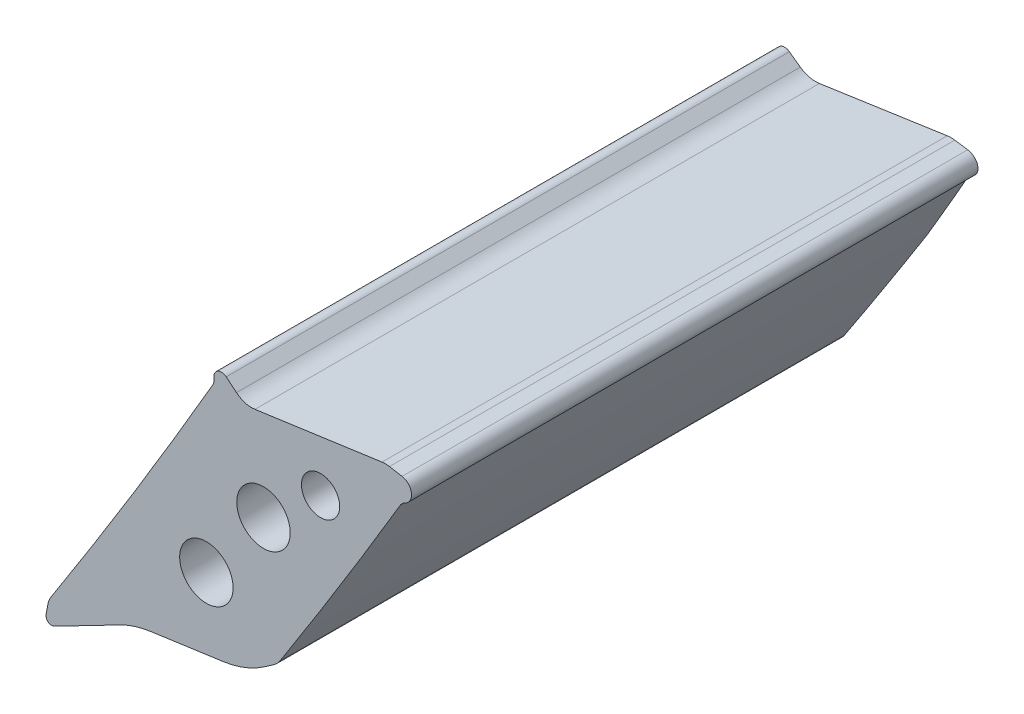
ISO-10303-21;
HEADER;
FILE_DESCRIPTION(('STEP AP214'),'2;1');
FILE_NAME('part.step','',(''),(''),'','','');
FILE_SCHEMA(('AUTOMOTIVE_DESIGN { 1 0 10303 214 1 1 1 1 }'));
ENDSEC;
DATA;
#1=APPLICATION_CONTEXT('core data for automotive mechanical design processes');
#2=APPLICATION_PROTOCOL_DEFINITION('international standard','automotive_design',2000,#1);
#3=PRODUCT_CONTEXT('',#1,'mechanical');
#4=PRODUCT('Part','Part','',(#3));
#5=PRODUCT_RELATED_PRODUCT_CATEGORY('part','',(#4));
#6=PRODUCT_DEFINITION_FORMATION('','',#4);
#7=PRODUCT_DEFINITION_CONTEXT('part definition',#1,'design');
#8=PRODUCT_DEFINITION('design','',#6,#7);
#9=PRODUCT_DEFINITION_SHAPE('','',#8);
#10=(LENGTH_UNIT() NAMED_UNIT(*) SI_UNIT(.MILLI.,.METRE.));
#11=(NAMED_UNIT(*) PLANE_ANGLE_UNIT() SI_UNIT($,.RADIAN.));
#12=(NAMED_UNIT(*) SI_UNIT($,.STERADIAN.) SOLID_ANGLE_UNIT());
#13=UNCERTAINTY_MEASURE_WITH_UNIT(LENGTH_MEASURE(1.E-05),#10,'distance_accuracy_value','');
#14=(GEOMETRIC_REPRESENTATION_CONTEXT(3) GLOBAL_UNCERTAINTY_ASSIGNED_CONTEXT((#13)) GLOBAL_UNIT_ASSIGNED_CONTEXT((#10,
#11,#12)) REPRESENTATION_CONTEXT('',''));
#15=CARTESIAN_POINT('',(0.,0.,0.));
#16=DIRECTION('',(0.,0.,1.));
#17=DIRECTION('',(1.,0.,0.));
#18=AXIS2_PLACEMENT_3D('',#15,#16,#17);
#19=CARTESIAN_POINT('',(-788.672703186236,20.720571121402,71.9582));
#20=DIRECTION('',(0.,0.,1.));
#21=DIRECTION('',(1.00000000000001,0.,0.));
#22=AXIS2_PLACEMENT_3D('',#19,#20,#21);
#23=PLANE('',#22);
#24=CARTESIAN_POINT('',(-762.88900000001,45.720000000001,71.9582));
#25=DIRECTION('',(0.,0.,-1.));
#26=DIRECTION('',(-1.00000000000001,0.,0.));
#27=AXIS2_PLACEMENT_3D('',#24,#25,#26);
#28=CIRCLE('',#27,3.56869999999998);
#29=CARTESIAN_POINT('',(-766.45770000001,45.720000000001,71.9582));
#30=VERTEX_POINT('',#29);
#31=EDGE_CURVE('E347',#30,#30,#28,.T.);
#32=ORIENTED_EDGE('',*,*,#31,.T.);
#33=EDGE_LOOP('',(#32));
#34=FACE_BOUND('',#33,.T.);
#35=CARTESIAN_POINT('',(-788.672703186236,20.720571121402,71.9582));
#36=DIRECTION('',(0.,0.,1.));
#37=DIRECTION('',(1.00000000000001,0.,0.));
#38=AXIS2_PLACEMENT_3D('',#35,#36,#37);
#39=CIRCLE('',#38,3.04799999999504);
#40=CARTESIAN_POINT('',(-791.234172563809,22.3725937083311,71.9582));
#41=VERTEX_POINT('',#40);
#42=CARTESIAN_POINT('',(-791.670058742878,21.2738917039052,71.9582));
#43=VERTEX_POINT('',#42);
#44=EDGE_CURVE('E351',#41,#43,#39,.T.);
#45=ORIENTED_EDGE('',*,*,#44,.T.);
#46=DIRECTION('',(-0.181535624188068,-0.983384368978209,0.));
#47=VECTOR('',#46,1.);
#48=CARTESIAN_POINT('',(-791.902339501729,20.0156192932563,71.9582));
#49=LINE('',#48,#47);
#50=CARTESIAN_POINT('',(-791.902339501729,20.0156192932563,71.9582));
#51=VERTEX_POINT('',#50);
#52=EDGE_CURVE('E720',#43,#51,#49,.T.);
#53=ORIENTED_EDGE('',*,*,#52,.T.);
#54=CARTESIAN_POINT('',(-791.153000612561,19.8772891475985,71.9582));
#55=DIRECTION('',(0.,0.,1.));
#56=DIRECTION('',(1.00000000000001,0.,0.));
#57=AXIS2_PLACEMENT_3D('',#54,#55,#56);
#58=CIRCLE('',#57,0.761999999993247);
#59=CARTESIAN_POINT('',(-790.803192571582,19.2003265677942,71.9582));
#60=VERTEX_POINT('',#59);
#61=EDGE_CURVE('E725',#51,#60,#58,.T.);
#62=ORIENTED_EDGE('',*,*,#61,.T.);
#63=DIRECTION('',(0.888402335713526,0.459065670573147,0.));
#64=VECTOR('',#63,1.);
#65=CARTESIAN_POINT('',(-790.803192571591,19.2003265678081,71.9582));
#66=LINE('',#65,#64);
#67=CARTESIAN_POINT('',(-782.053130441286,23.7217612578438,71.9582));
#68=VERTEX_POINT('',#67);
#69=EDGE_CURVE('E734',#60,#68,#66,.T.);
#70=ORIENTED_EDGE('',*,*,#69,.T.);
#71=CARTESIAN_POINT('',(-776.222996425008,12.4390515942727,71.9582));
#72=DIRECTION('',(0.,0.,-1.));
#73=DIRECTION('',(-1.00000000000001,0.,0.));
#74=AXIS2_PLACEMENT_3D('',#71,#72,#73);
#75=CIRCLE('',#74,12.7000000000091);
#76=CARTESIAN_POINT('',(-777.990494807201,25.0154560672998,71.9582));
#77=VERTEX_POINT('',#76);
#78=EDGE_CURVE('E736',#68,#77,#75,.T.);
#79=ORIENTED_EDGE('',*,*,#78,.T.);
#80=DIRECTION('',(0.990268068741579,0.13917310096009,0.));
#81=VECTOR('',#80,1.);
#82=CARTESIAN_POINT('',(-777.9904948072,25.0154560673,71.9582));
#83=LINE('',#82,#81);
#84=CARTESIAN_POINT('',(-768.23713557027,26.3862013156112,71.9582));
#85=VERTEX_POINT('',#84);
#86=EDGE_CURVE('E740',#77,#85,#83,.T.);
#87=ORIENTED_EDGE('',*,*,#86,.T.);
#88=CARTESIAN_POINT('',(-770.00463395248,38.9626057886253,71.9582));
#89=DIRECTION('',(0.,0.,1.));
#90=DIRECTION('',(-1.00000000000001,0.,0.));
#91=AXIS2_PLACEMENT_3D('',#88,#89,#90);
#92=CIRCLE('',#91,12.7000000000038);
#93=CARTESIAN_POINT('',(-762.747509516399,28.5403150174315,71.9582));
#94=VERTEX_POINT('',#93);
#95=EDGE_CURVE('E743',#85,#94,#92,.T.);
#96=ORIENTED_EDGE('',*,*,#95,.T.);
#97=DIRECTION('',(0.820652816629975,0.57142712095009,0.));
#98=VECTOR('',#97,1.);
#99=CARTESIAN_POINT('',(-761.496834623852,29.4111699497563,71.9582));
#100=LINE('',#99,#98);
#101=CARTESIAN_POINT('',(-761.496834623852,29.4111699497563,71.9582));
#102=VERTEX_POINT('',#101);
#103=EDGE_CURVE('E746',#94,#102,#100,.T.);
#104=ORIENTED_EDGE('',*,*,#103,.T.);
#105=CARTESIAN_POINT('',(-763.238544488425,31.9125197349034,71.9582));
#106=DIRECTION('',(0.,0.,1.));
#107=DIRECTION('',(1.00000000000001,0.,0.));
#108=AXIS2_PLACEMENT_3D('',#105,#106,#107);
#109=CIRCLE('',#108,3.0480000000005);
#110=CARTESIAN_POINT('',(-760.67385604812,30.2654990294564,71.9582));
#111=VERTEX_POINT('',#110);
#112=EDGE_CURVE('E748',#102,#111,#109,.T.);
#113=ORIENTED_EDGE('',*,*,#112,.T.);
#114=CARTESIAN_POINT('',(-1472.81446147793,487.59602850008,71.9582));
#115=DIRECTION('',(0.,0.,1.));
#116=DIRECTION('',(1.00000000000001,0.,0.));
#117=AXIS2_PLACEMENT_3D('',#114,#115,#116);
#118=CIRCLE('',#117,846.342398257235);
#119=CARTESIAN_POINT('',(-744.63617179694,56.2587665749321,71.9582));
#120=VERTEX_POINT('',#119);
#121=EDGE_CURVE('E662',#111,#120,#118,.T.);
#122=ORIENTED_EDGE('',*,*,#121,.T.);
#123=CARTESIAN_POINT('',(-743.324948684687,55.482062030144,71.9582));
#124=DIRECTION('',(0.,0.,-1.));
#125=DIRECTION('',(-1.00000000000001,0.,0.));
#126=AXIS2_PLACEMENT_3D('',#123,#124,#125);
#127=CIRCLE('',#126,1.52399999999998);
#128=CARTESIAN_POINT('',(-743.989658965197,56.8534614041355,71.9582));
#129=VERTEX_POINT('',#128);
#130=EDGE_CURVE('E652',#120,#129,#127,.T.);
#131=ORIENTED_EDGE('',*,*,#130,.T.);
#132=CARTESIAN_POINT('',(-744.654369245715,58.2248607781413,71.9582));
#133=DIRECTION('',(0.,0.,1.));
#134=DIRECTION('',(1.00000000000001,0.,0.));
#135=AXIS2_PLACEMENT_3D('',#132,#133,#134);
#136=CIRCLE('',#135,1.52400000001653);
#137=CARTESIAN_POINT('',(-744.389729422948,59.725707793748,71.9582));
#138=VERTEX_POINT('',#137);
#139=EDGE_CURVE('E648',#129,#138,#136,.T.);
#140=ORIENTED_EDGE('',*,*,#139,.T.);
#141=DIRECTION('',(-0.98480775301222,0.17364817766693,0.));
#142=VECTOR('',#141,1.);
#143=CARTESIAN_POINT('',(-746.074422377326,60.022764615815,71.9582));
#144=LINE('',#143,#142);
#145=CARTESIAN_POINT('',(-746.074422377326,60.022764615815,71.9582));
#146=VERTEX_POINT('',#145);
#147=EDGE_CURVE('E666',#138,#146,#144,.T.);
#148=ORIENTED_EDGE('',*,*,#147,.T.);
#149=CARTESIAN_POINT('',(-746.625755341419,56.8960000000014,71.9582));
#150=DIRECTION('',(0.,0.,1.));
#151=DIRECTION('',(-1.00000000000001,0.,0.));
#152=AXIS2_PLACEMENT_3D('',#149,#150,#151);
#153=CIRCLE('',#152,3.17500000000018);
#154=CARTESIAN_POINT('',(-747.067629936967,60.0401011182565,71.9582));
#155=VERTEX_POINT('',#154);
#156=EDGE_CURVE('E668',#146,#155,#153,.T.);
#157=ORIENTED_EDGE('',*,*,#156,.T.);
#158=DIRECTION('',(-0.990268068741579,-0.139173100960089,0.));
#159=VECTOR('',#158,1.);
#160=CARTESIAN_POINT('',(-764.023887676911,57.657054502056,71.9582));
#161=LINE('',#160,#159);
#162=CARTESIAN_POINT('',(-764.023887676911,57.657054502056,71.9582));
#163=VERTEX_POINT('',#162);
#164=EDGE_CURVE('E579',#155,#163,#161,.T.);
#165=ORIENTED_EDGE('',*,*,#164,.T.);
#166=CARTESIAN_POINT('',(-764.46576227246,60.8011556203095,71.9582));
#167=DIRECTION('',(0.,0.,-1.));
#168=DIRECTION('',(1.00000000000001,0.,0.));
#169=AXIS2_PLACEMENT_3D('',#166,#167,#168);
#170=CIRCLE('',#169,3.17499999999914);
#171=CARTESIAN_POINT('',(-766.493107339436,58.3576955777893,71.9582));
#172=VERTEX_POINT('',#171);
#173=EDGE_CURVE('E575',#163,#172,#170,.T.);
#174=ORIENTED_EDGE('',*,*,#173,.T.);
#175=DIRECTION('',(-0.769593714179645,0.638533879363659,0.));
#176=VECTOR('',#175,1.);
#177=CARTESIAN_POINT('',(-767.861444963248,59.4930088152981,71.9582));
#178=LINE('',#177,#176);
#179=CARTESIAN_POINT('',(-767.861444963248,59.4930088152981,71.9582));
#180=VERTEX_POINT('',#179);
#181=EDGE_CURVE('E572',#172,#180,#178,.T.);
#182=ORIENTED_EDGE('',*,*,#181,.T.);
#183=CARTESIAN_POINT('',(-768.499978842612,58.7234151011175,71.9582));
#184=DIRECTION('',(0.,0.,1.));
#185=DIRECTION('',(1.00000000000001,0.,0.));
#186=AXIS2_PLACEMENT_3D('',#183,#184,#185);
#187=CIRCLE('',#186,1.00000000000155);
#188=CARTESIAN_POINT('',(-769.491045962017,58.5900510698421,71.9582));
#189=VERTEX_POINT('',#188);
#190=EDGE_CURVE('E569',#180,#189,#187,.T.);
#191=ORIENTED_EDGE('',*,*,#190,.T.);
#192=CARTESIAN_POINT('',(-771.001432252,58.3868042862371,71.9582));
#193=DIRECTION('',(0.,0.,-1.));
#194=DIRECTION('',(1.00000000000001,0.,0.));
#195=AXIS2_PLACEMENT_3D('',#192,#193,#194);
#196=CIRCLE('',#195,1.52400000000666);
#197=CARTESIAN_POINT('',(-769.682432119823,57.6233813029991,71.9582));
#198=VERTEX_POINT('',#197);
#199=EDGE_CURVE('E565',#189,#198,#196,.T.);
#200=ORIENTED_EDGE('',*,*,#199,.T.);
#201=CARTESIAN_POINT('',(-1512.56546147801,487.596028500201,71.9582));
#202=DIRECTION('',(0.,0.,-1.));
#203=DIRECTION('',(1.00000000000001,0.,0.));
#204=AXIS2_PLACEMENT_3D('',#201,#202,#203);
#205=CIRCLE('',#204,858.342398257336);
#206=EDGE_CURVE('E551',#198,#41,#205,.T.);
#207=ORIENTED_EDGE('',*,*,#206,.T.);
#208=EDGE_LOOP('',(#45,#53,#62,#70,#79,#87,#96,#104,#113,#122,#131,#140,#148,#157,#165,#174,
#182,#191,#200,#207));
#209=FACE_BOUND('',#208,.T.);
#210=CARTESIAN_POINT('',(-755.26900000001,52.0700000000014,71.9582));
#211=DIRECTION('',(0.,0.,1.));
#212=DIRECTION('',(1.00000000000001,0.,0.));
#213=AXIS2_PLACEMENT_3D('',#210,#211,#212);
#214=CIRCLE('',#213,2.55269999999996);
#215=CARTESIAN_POINT('',(-752.71630000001,52.0700000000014,71.9582));
#216=VERTEX_POINT('',#215);
#217=EDGE_CURVE('E356',#216,#216,#214,.T.);
#218=ORIENTED_EDGE('',*,*,#217,.F.);
#219=EDGE_LOOP('',(#218));
#220=FACE_BOUND('',#219,.T.);
#221=CARTESIAN_POINT('',(-770.509000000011,35.5600000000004,71.9582));
#222=DIRECTION('',(0.,0.,-1.));
#223=DIRECTION('',(-1.00000000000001,0.,0.));
#224=AXIS2_PLACEMENT_3D('',#221,#222,#223);
#225=CIRCLE('',#224,3.56869999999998);
#226=CARTESIAN_POINT('',(-774.077700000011,35.5600000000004,71.9582));
#227=VERTEX_POINT('',#226);
#228=EDGE_CURVE('E359',#227,#227,#225,.T.);
#229=ORIENTED_EDGE('',*,*,#228,.T.);
#230=EDGE_LOOP('',(#229));
#231=FACE_BOUND('',#230,.T.);
#232=ADVANCED_FACE('F62',(#34,#209,#220,#231),#23,.T.);
#233=CARTESIAN_POINT('',(-788.672703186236,20.720571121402,71.9582));
#234=DIRECTION('',(0.,0.,-1.));
#235=DIRECTION('',(-1.00000000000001,0.,0.));
#236=AXIS2_PLACEMENT_3D('',#233,#234,#235);
#237=CYLINDRICAL_SURFACE('',#236,3.04799999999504);
#238=DIRECTION('',(0.,0.,-1.));
#239=VECTOR('',#238,1.);
#240=CARTESIAN_POINT('',(-791.234172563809,22.3725937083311,71.9582));
#241=LINE('',#240,#239);
#242=CARTESIAN_POINT('',(-791.234172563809,22.3725937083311,-3.37509347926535));
#243=VERTEX_POINT('',#242);
#244=EDGE_CURVE('E545',#41,#243,#241,.T.);
#245=ORIENTED_EDGE('',*,*,#244,.T.);
#246=CARTESIAN_POINT('',(-788.672703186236,20.720571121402,-3.23729267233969));
#247=DIRECTION('',(-0.0146503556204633,0.0605359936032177,0.998058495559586));
#248=DIRECTION('',(-0.234763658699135,0.970055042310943,-0.0622835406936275));
#249=AXIS2_PLACEMENT_3D('',#246,#247,#248);
#250=ELLIPSE('',#249,3.05392921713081,3.04799999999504);
#251=CARTESIAN_POINT('',(-791.670058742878,21.2738917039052,-3.31485138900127));
#252=VERTEX_POINT('',#251);
#253=EDGE_CURVE('E78',#243,#252,#250,.T.);
#254=ORIENTED_EDGE('',*,*,#253,.T.);
#255=DIRECTION('',(0.,0.,-1.));
#256=VECTOR('',#255,1.);
#257=CARTESIAN_POINT('',(-791.670058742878,21.2738917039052,71.9582));
#258=LINE('',#257,#256);
#259=EDGE_CURVE('E528',#43,#252,#258,.T.);
#260=ORIENTED_EDGE('',*,*,#259,.F.);
#261=ORIENTED_EDGE('',*,*,#44,.F.);
#262=EDGE_LOOP('',(#245,#254,#260,#261));
#263=FACE_BOUND('',#262,.T.);
#264=ADVANCED_FACE('F64',(#263),#237,.T.);
#265=CARTESIAN_POINT('',(-791.902339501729,20.0156192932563,71.9582));
#266=DIRECTION('',(0.983384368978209,-0.181535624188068,0.));
#267=DIRECTION('',(0.181535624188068,0.983384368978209,0.));
#268=AXIS2_PLACEMENT_3D('',#265,#266,#267);
#269=PLANE('',#268);
#270=ORIENTED_EDGE('',*,*,#259,.T.);
#271=DIRECTION('',(-0.181241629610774,-0.981791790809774,0.0568889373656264));
#272=VECTOR('',#271,1.);
#273=CARTESIAN_POINT('',(-792.677701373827,15.8154588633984,-2.99856799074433));
#274=LINE('',#273,#272);
#275=CARTESIAN_POINT('',(-791.902339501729,20.0156192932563,-3.24194206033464));
#276=VERTEX_POINT('',#275);
#277=EDGE_CURVE('E508',#252,#276,#274,.T.);
#278=ORIENTED_EDGE('',*,*,#277,.T.);
#279=DIRECTION('',(0.,0.,-1.));
#280=VECTOR('',#279,1.);
#281=CARTESIAN_POINT('',(-791.902339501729,20.0156192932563,71.9582));
#282=LINE('',#281,#280);
#283=EDGE_CURVE('E523',#51,#276,#282,.T.);
#284=ORIENTED_EDGE('',*,*,#283,.F.);
#285=ORIENTED_EDGE('',*,*,#52,.F.);
#286=EDGE_LOOP('',(#270,#278,#284,#285));
#287=FACE_BOUND('',#286,.T.);
#288=ADVANCED_FACE('F342',(#287),#269,.F.);
#289=CARTESIAN_POINT('',(-791.153000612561,19.8772891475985,71.9582));
#290=DIRECTION('',(0.,0.,-1.));
#291=DIRECTION('',(-1.00000000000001,0.,0.));
#292=AXIS2_PLACEMENT_3D('',#289,#290,#291);
#293=CYLINDRICAL_SURFACE('',#292,0.761999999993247);
#294=ORIENTED_EDGE('',*,*,#283,.T.);
#295=CARTESIAN_POINT('',(-791.153000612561,19.8772891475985,-3.2225523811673));
#296=DIRECTION('',(-0.0146503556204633,0.0605359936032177,0.998058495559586));
#297=DIRECTION('',(-0.234763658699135,0.970055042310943,-0.0622835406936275));
#298=AXIS2_PLACEMENT_3D('',#295,#296,#297);
#299=ELLIPSE('',#298,0.763482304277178,0.761999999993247);
#300=CARTESIAN_POINT('',(-790.803192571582,19.2003265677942,-3.17635727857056));
#301=VERTEX_POINT('',#300);
#302=EDGE_CURVE('E503',#276,#301,#299,.T.);
#303=ORIENTED_EDGE('',*,*,#302,.T.);
#304=DIRECTION('',(0.,0.,-1.));
#305=VECTOR('',#304,1.);
#306=CARTESIAN_POINT('',(-790.803192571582,19.2003265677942,71.9582));
#307=LINE('',#306,#305);
#308=EDGE_CURVE('E520',#60,#301,#307,.T.);
#309=ORIENTED_EDGE('',*,*,#308,.F.);
#310=ORIENTED_EDGE('',*,*,#61,.F.);
#311=EDGE_LOOP('',(#294,#303,#309,#310));
#312=FACE_BOUND('',#311,.T.);
#313=ADVANCED_FACE('F836',(#312),#293,.T.);
#314=CARTESIAN_POINT('',(-790.803192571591,19.2003265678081,71.9582));
#315=DIRECTION('',(-0.459065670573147,0.888402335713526,0.));
#316=DIRECTION('',(-0.888402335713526,-0.459065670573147,0.));
#317=AXIS2_PLACEMENT_3D('',#314,#315,#316);
#318=PLANE('',#317);
#319=ORIENTED_EDGE('',*,*,#308,.T.);
#320=DIRECTION('',(0.888305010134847,0.459015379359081,-0.0148017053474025));
#321=VECTOR('',#320,1.);
#322=CARTESIAN_POINT('',(-791.791093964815,18.6898465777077,-3.15989601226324));
#323=LINE('',#322,#321);
#324=CARTESIAN_POINT('',(-782.053130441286,23.7217612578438,-3.32215837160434));
#325=VERTEX_POINT('',#324);
#326=EDGE_CURVE('E499',#301,#325,#323,.T.);
#327=ORIENTED_EDGE('',*,*,#326,.T.);
#328=DIRECTION('',(0.,0.,-1.));
#329=VECTOR('',#328,1.);
#330=CARTESIAN_POINT('',(-782.053130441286,23.7217612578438,71.9582));
#331=LINE('',#330,#329);
#332=EDGE_CURVE('E515',#68,#325,#331,.T.);
#333=ORIENTED_EDGE('',*,*,#332,.F.);
#334=ORIENTED_EDGE('',*,*,#69,.F.);
#335=EDGE_LOOP('',(#319,#327,#333,#334));
#336=FACE_BOUND('',#335,.T.);
#337=ADVANCED_FACE('F832',(#336),#318,.F.);
#338=CARTESIAN_POINT('',(-776.222996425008,12.4390515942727,71.9582));
#339=DIRECTION('',(0.,0.,-1.));
#340=DIRECTION('',(-1.00000000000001,0.,0.));
#341=AXIS2_PLACEMENT_3D('',#338,#339,#340);
#342=CYLINDRICAL_SURFACE('',#341,12.7000000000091);
#343=ORIENTED_EDGE('',*,*,#332,.T.);
#344=CARTESIAN_POINT('',(-776.222996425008,12.4390515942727,-2.55223999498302));
#345=DIRECTION('',(-0.0146503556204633,0.0605359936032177,0.998058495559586));
#346=DIRECTION('',(-0.234763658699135,0.970055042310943,-0.0622835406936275));
#347=AXIS2_PLACEMENT_3D('',#344,#345,#346);
#348=ELLIPSE('',#347,12.7247050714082,12.7000000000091);
#349=CARTESIAN_POINT('',(-777.990494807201,25.0154560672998,-3.34099097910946));
#350=VERTEX_POINT('',#349);
#351=EDGE_CURVE('E495',#325,#350,#348,.F.);
#352=ORIENTED_EDGE('',*,*,#351,.T.);
#353=DIRECTION('',(0.,0.,-1.));
#354=VECTOR('',#353,1.);
#355=CARTESIAN_POINT('',(-777.990494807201,25.0154560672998,71.9582));
#356=LINE('',#355,#354);
#357=EDGE_CURVE('E480',#77,#350,#356,.T.);
#358=ORIENTED_EDGE('',*,*,#357,.F.);
#359=ORIENTED_EDGE('',*,*,#78,.F.);
#360=EDGE_LOOP('',(#343,#352,#358,#359));
#361=FACE_BOUND('',#360,.T.);
#362=ADVANCED_FACE('F828',(#361),#342,.F.);
#363=CARTESIAN_POINT('',(-777.9904948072,25.0154560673,71.9582));
#364=DIRECTION('',(-0.13917310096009,0.990268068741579,0.));
#365=DIRECTION('',(-0.990268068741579,-0.13917310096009,0.));
#366=AXIS2_PLACEMENT_3D('',#363,#364,#365);
#367=PLANE('',#366);
#368=ORIENTED_EDGE('',*,*,#357,.T.);
#369=DIRECTION('',(0.990249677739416,0.139170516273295,0.00609451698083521));
#370=VECTOR('',#369,1.);
#371=CARTESIAN_POINT('',(-777.536057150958,25.0793231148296,-3.33819413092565));
#372=LINE('',#371,#370);
#373=CARTESIAN_POINT('',(-768.23713557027,26.3862013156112,-3.28096368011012));
#374=VERTEX_POINT('',#373);
#375=EDGE_CURVE('E491',#350,#374,#372,.T.);
#376=ORIENTED_EDGE('',*,*,#375,.T.);
#377=DIRECTION('',(0.,0.,-1.));
#378=VECTOR('',#377,1.);
#379=CARTESIAN_POINT('',(-768.23713557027,26.3862013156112,71.9582));
#380=LINE('',#379,#378);
#381=EDGE_CURVE('E475',#85,#374,#380,.T.);
#382=ORIENTED_EDGE('',*,*,#381,.F.);
#383=ORIENTED_EDGE('',*,*,#86,.F.);
#384=EDGE_LOOP('',(#368,#376,#382,#383));
#385=FACE_BOUND('',#384,.T.);
#386=ADVANCED_FACE('F824',(#385),#367,.F.);
#387=CARTESIAN_POINT('',(-770.00463395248,38.9626057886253,71.9582));
#388=DIRECTION('',(0.,0.,-1.));
#389=DIRECTION('',(-1.00000000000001,0.,0.));
#390=AXIS2_PLACEMENT_3D('',#387,#388,#389);
#391=CYLINDRICAL_SURFACE('',#390,12.7000000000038);
#392=ORIENTED_EDGE('',*,*,#381,.T.);
#393=CARTESIAN_POINT('',(-770.00463395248,38.9626057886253,-4.06971466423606));
#394=DIRECTION('',(-0.0146503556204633,0.0605359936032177,0.998058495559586));
#395=DIRECTION('',(-0.234763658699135,0.970055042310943,-0.0622835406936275));
#396=AXIS2_PLACEMENT_3D('',#393,#394,#395);
#397=ELLIPSE('',#396,12.7247050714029,12.7000000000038);
#398=CARTESIAN_POINT('',(-762.747509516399,28.5403150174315,-3.33103733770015));
#399=VERTEX_POINT('',#398);
#400=EDGE_CURVE('E446',#374,#399,#397,.T.);
#401=ORIENTED_EDGE('',*,*,#400,.T.);
#402=DIRECTION('',(0.,0.,-1.));
#403=VECTOR('',#402,1.);
#404=CARTESIAN_POINT('',(-762.747509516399,28.5403150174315,71.9582));
#405=LINE('',#404,#403);
#406=EDGE_CURVE('E471',#94,#399,#405,.T.);
#407=ORIENTED_EDGE('',*,*,#406,.F.);
#408=ORIENTED_EDGE('',*,*,#95,.F.);
#409=EDGE_LOOP('',(#392,#401,#407,#408));
#410=FACE_BOUND('',#409,.T.);
#411=ADVANCED_FACE('F820',(#410),#391,.T.);
#412=CARTESIAN_POINT('',(-761.496834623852,29.4111699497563,71.9582));
#413=DIRECTION('',(-0.57142712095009,0.820652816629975,0.));
#414=DIRECTION('',(-0.820652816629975,-0.57142712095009,0.));
#415=AXIS2_PLACEMENT_3D('',#412,#413,#414);
#416=PLANE('',#415);
#417=ORIENTED_EDGE('',*,*,#406,.T.);
#418=DIRECTION('',(0.82044307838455,0.571281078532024,-0.0226071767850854));
#419=VECTOR('',#418,1.);
#420=CARTESIAN_POINT('',(-762.893931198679,28.4383604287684,-3.32700271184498));
#421=LINE('',#420,#419);
#422=CARTESIAN_POINT('',(-761.496834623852,29.4111699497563,-3.36549948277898));
#423=VERTEX_POINT('',#422);
#424=EDGE_CURVE('E443',#399,#423,#421,.T.);
#425=ORIENTED_EDGE('',*,*,#424,.T.);
#426=DIRECTION('',(0.,0.,-1.));
#427=VECTOR('',#426,1.);
#428=CARTESIAN_POINT('',(-761.496834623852,29.4111699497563,71.9582));
#429=LINE('',#428,#427);
#430=EDGE_CURVE('E441',#102,#423,#429,.T.);
#431=ORIENTED_EDGE('',*,*,#430,.F.);
#432=ORIENTED_EDGE('',*,*,#103,.F.);
#433=EDGE_LOOP('',(#417,#425,#431,#432));
#434=FACE_BOUND('',#433,.T.);
#435=ADVANCED_FACE('F817',(#434),#416,.F.);
#436=CARTESIAN_POINT('',(-763.238544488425,31.9125197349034,71.9582));
#437=DIRECTION('',(0.,0.,-1.));
#438=DIRECTION('',(-1.00000000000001,0.,0.));
#439=AXIS2_PLACEMENT_3D('',#436,#437,#438);
#440=CYLINDRICAL_SURFACE('',#439,3.0480000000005);
#441=ORIENTED_EDGE('',*,*,#430,.T.);
#442=CARTESIAN_POINT('',(-763.238544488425,31.9125197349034,-3.54278204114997));
#443=DIRECTION('',(-0.0146503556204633,0.0605359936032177,0.998058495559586));
#444=DIRECTION('',(-0.234763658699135,0.970055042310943,-0.0622835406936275));
#445=AXIS2_PLACEMENT_3D('',#442,#443,#444);
#446=ELLIPSE('',#445,3.05392921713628,3.0480000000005);
#447=CARTESIAN_POINT('',(-760.67385604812,30.2654990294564,-3.40523736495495));
#448=VERTEX_POINT('',#447);
#449=EDGE_CURVE('E256',#423,#448,#446,.T.);
#450=ORIENTED_EDGE('',*,*,#449,.T.);
#451=DIRECTION('',(0.,0.,-1.));
#452=VECTOR('',#451,1.);
#453=CARTESIAN_POINT('',(-760.67385604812,30.2654990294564,71.9582));
#454=LINE('',#453,#452);
#455=EDGE_CURVE('E433',#111,#448,#454,.T.);
#456=ORIENTED_EDGE('',*,*,#455,.F.);
#457=ORIENTED_EDGE('',*,*,#112,.F.);
#458=EDGE_LOOP('',(#441,#450,#456,#457));
#459=FACE_BOUND('',#458,.T.);
#460=ADVANCED_FACE('F438',(#459),#440,.T.);
#461=CARTESIAN_POINT('',(-1472.81446147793,487.59602850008,71.9582));
#462=DIRECTION('',(0.,0.,-1.));
#463=DIRECTION('',(-1.00000000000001,0.,0.));
#464=AXIS2_PLACEMENT_3D('',#461,#462,#463);
#465=CYLINDRICAL_SURFACE('',#464,846.342398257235);
#466=CARTESIAN_POINT('',(-750.515766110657,46.4837414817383,-4.2398255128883));
#467=CARTESIAN_POINT('',(-750.507990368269,46.4964738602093,-4.24048303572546));
#468=CARTESIAN_POINT('',(-750.500214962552,46.5092064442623,-4.24081179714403));
#469=CARTESIAN_POINT('',(-750.484664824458,46.5346720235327,-4.24081179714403));
#470=CARTESIAN_POINT('',(-750.476890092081,46.5474050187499,-4.24048303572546));
#471=CARTESIAN_POINT('',(-750.469115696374,46.5601382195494,-4.2398255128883));
#472=B_SPLINE_CURVE_WITH_KNOTS('',3,(#466,#467,#468,#469,#470,#471),.UNSPECIFIED.,.F.,.F.,(4,2,
4),(0.,0.0447677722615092,0.0895355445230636),.UNSPECIFIED.);
#473=CARTESIAN_POINT('',(-750.515766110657,46.4837414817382,-4.2398255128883));
#474=VERTEX_POINT('',#473);
#475=CARTESIAN_POINT('',(-750.469115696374,46.5601382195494,-4.2398255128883));
#476=VERTEX_POINT('',#475);
#477=EDGE_CURVE('E246',#474,#476,#472,.T.);
#478=ORIENTED_EDGE('',*,*,#477,.T.);
#479=CARTESIAN_POINT('',(-1472.81446147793,487.59602850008,33.1138588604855));
#480=DIRECTION('',(0.0146503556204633,-0.0605359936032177,0.998058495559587));
#481=DIRECTION('',(0.234763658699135,-0.970055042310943,-0.0622835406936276));
#482=AXIS2_PLACEMENT_3D('',#479,#480,#481);
#483=ELLIPSE('',#482,847.988772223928,846.342398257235);
#484=CARTESIAN_POINT('',(-744.63617179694,56.2587665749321,-3.73718823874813));
#485=VERTEX_POINT('',#484);
#486=EDGE_CURVE('E387',#476,#485,#483,.T.);
#487=ORIENTED_EDGE('',*,*,#486,.T.);
#488=DIRECTION('',(0.,0.,-1.));
#489=VECTOR('',#488,1.);
#490=CARTESIAN_POINT('',(-744.63617179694,56.2587665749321,71.9582));
#491=LINE('',#490,#489);
#492=EDGE_CURVE('E460',#120,#485,#491,.T.);
#493=ORIENTED_EDGE('',*,*,#492,.F.);
#494=ORIENTED_EDGE('',*,*,#121,.F.);
#495=ORIENTED_EDGE('',*,*,#455,.T.);
#496=CARTESIAN_POINT('',(-1472.81446147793,487.59602850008,-41.5974588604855));
#497=DIRECTION('',(-0.0146503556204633,0.0605359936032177,0.998058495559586));
#498=DIRECTION('',(-0.234763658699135,0.970055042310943,-0.0622835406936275));
#499=AXIS2_PLACEMENT_3D('',#496,#497,#498);
#500=ELLIPSE('',#499,847.988772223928,846.342398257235);
#501=EDGE_CURVE('E247',#448,#474,#500,.T.);
#502=ORIENTED_EDGE('',*,*,#501,.T.);
#503=EDGE_LOOP('',(#478,#487,#493,#494,#495,#502));
#504=FACE_BOUND('',#503,.T.);
#505=ADVANCED_FACE('F429',(#504),#465,.T.);
#506=CARTESIAN_POINT('',(-743.324948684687,55.482062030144,71.9582));
#507=DIRECTION('',(0.,0.,-1.));
#508=DIRECTION('',(-1.00000000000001,0.,0.));
#509=AXIS2_PLACEMENT_3D('',#506,#507,#508);
#510=CYLINDRICAL_SURFACE('',#509,1.52399999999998);
#511=ORIENTED_EDGE('',*,*,#492,.T.);
#512=CARTESIAN_POINT('',(-743.324948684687,55.482062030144,-3.80354553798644));
#513=DIRECTION('',(0.0146503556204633,-0.0605359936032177,0.998058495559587));
#514=DIRECTION('',(0.234763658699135,-0.970055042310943,-0.0622835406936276));
#515=AXIS2_PLACEMENT_3D('',#512,#513,#514);
#516=ELLIPSE('',#515,1.52696460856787,1.52399999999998);
#517=CARTESIAN_POINT('',(-743.989658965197,56.8534614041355,-3.71060783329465));
#518=VERTEX_POINT('',#517);
#519=EDGE_CURVE('E419',#485,#518,#516,.F.);
#520=ORIENTED_EDGE('',*,*,#519,.T.);
#521=DIRECTION('',(0.,0.,-1.));
#522=VECTOR('',#521,1.);
#523=CARTESIAN_POINT('',(-743.989658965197,56.8534614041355,71.9582));
#524=LINE('',#523,#522);
#525=EDGE_CURVE('E464',#129,#518,#524,.T.);
#526=ORIENTED_EDGE('',*,*,#525,.F.);
#527=ORIENTED_EDGE('',*,*,#130,.F.);
#528=EDGE_LOOP('',(#511,#520,#526,#527));
#529=FACE_BOUND('',#528,.T.);
#530=ADVANCED_FACE('F651',(#529),#510,.F.);
#531=CARTESIAN_POINT('',(-744.654369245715,58.2248607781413,71.9582));
#532=DIRECTION('',(0.,0.,-1.));
#533=DIRECTION('',(-1.00000000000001,0.,0.));
#534=AXIS2_PLACEMENT_3D('',#531,#532,#533);
#535=CYLINDRICAL_SURFACE('',#534,1.52400000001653);
#536=ORIENTED_EDGE('',*,*,#525,.T.);
#537=CARTESIAN_POINT('',(-744.654369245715,58.2248607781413,-3.61767012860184));
#538=DIRECTION('',(0.0146503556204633,-0.0605359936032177,0.998058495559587));
#539=DIRECTION('',(0.234763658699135,-0.970055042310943,-0.0622835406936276));
#540=AXIS2_PLACEMENT_3D('',#537,#538,#539);
#541=ELLIPSE('',#540,1.52696460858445,1.52400000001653);
#542=CARTESIAN_POINT('',(-744.389729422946,59.7257077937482,-3.53052273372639));
#543=VERTEX_POINT('',#542);
#544=EDGE_CURVE('E647',#518,#543,#541,.T.);
#545=ORIENTED_EDGE('',*,*,#544,.T.);
#546=DIRECTION('',(0.,0.,-1.));
#547=VECTOR('',#546,1.);
#548=CARTESIAN_POINT('',(-744.389729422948,59.725707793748,71.9582));
#549=LINE('',#548,#547);
#550=EDGE_CURVE('E631',#138,#543,#549,.T.);
#551=ORIENTED_EDGE('',*,*,#550,.F.);
#552=ORIENTED_EDGE('',*,*,#139,.F.);
#553=EDGE_LOOP('',(#536,#545,#551,#552));
#554=FACE_BOUND('',#553,.T.);
#555=ADVANCED_FACE('F646',(#554),#535,.T.);
#556=CARTESIAN_POINT('',(-746.074422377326,60.022764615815,71.9582));
#557=DIRECTION('',(-0.17364817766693,-0.98480775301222,0.));
#558=DIRECTION('',(0.98480775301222,-0.17364817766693,0.));
#559=AXIS2_PLACEMENT_3D('',#556,#557,#558);
#560=PLANE('',#559);
#561=ORIENTED_EDGE('',*,*,#550,.T.);
#562=DIRECTION('',(-0.984500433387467,0.173593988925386,0.0249804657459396));
#563=VECTOR('',#562,1.);
#564=CARTESIAN_POINT('',(-747.929886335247,60.3499329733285,-3.44069568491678));
#565=LINE('',#564,#563);
#566=CARTESIAN_POINT('',(-746.074422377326,60.022764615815,-3.4877757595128));
#567=VERTEX_POINT('',#566);
#568=EDGE_CURVE('E610',#543,#567,#565,.T.);
#569=ORIENTED_EDGE('',*,*,#568,.T.);
#570=DIRECTION('',(0.,0.,-1.));
#571=VECTOR('',#570,1.);
#572=CARTESIAN_POINT('',(-746.074422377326,60.022764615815,71.9582));
#573=LINE('',#572,#571);
#574=EDGE_CURVE('E627',#146,#567,#573,.T.);
#575=ORIENTED_EDGE('',*,*,#574,.F.);
#576=ORIENTED_EDGE('',*,*,#147,.F.);
#577=EDGE_LOOP('',(#561,#569,#575,#576));
#578=FACE_BOUND('',#577,.T.);
#579=ADVANCED_FACE('F754',(#578),#560,.F.);
#580=CARTESIAN_POINT('',(-746.625755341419,56.8960000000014,71.9582));
#581=DIRECTION('',(0.,0.,-1.));
#582=DIRECTION('',(-1.00000000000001,0.,0.));
#583=AXIS2_PLACEMENT_3D('',#580,#581,#582);
#584=CYLINDRICAL_SURFACE('',#583,3.17500000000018);
#585=ORIENTED_EDGE('',*,*,#574,.T.);
#586=CARTESIAN_POINT('',(-746.625755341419,56.8960000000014,-3.66933283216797));
#587=DIRECTION('',(0.0146503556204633,-0.0605359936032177,0.998058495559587));
#588=DIRECTION('',(0.234763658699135,-0.970055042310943,-0.0622835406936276));
#589=AXIS2_PLACEMENT_3D('',#586,#587,#588);
#590=ELLIPSE('',#589,3.18117626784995,3.17500000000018);
#591=CARTESIAN_POINT('',(-747.067629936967,60.0401011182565,-3.4721450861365));
#592=VERTEX_POINT('',#591);
#593=EDGE_CURVE('E605',#567,#592,#590,.T.);
#594=ORIENTED_EDGE('',*,*,#593,.T.);
#595=DIRECTION('',(0.,0.,-1.));
#596=VECTOR('',#595,1.);
#597=CARTESIAN_POINT('',(-747.067629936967,60.0401011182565,71.9582));
#598=LINE('',#597,#596);
#599=EDGE_CURVE('E622',#155,#592,#598,.T.);
#600=ORIENTED_EDGE('',*,*,#599,.F.);
#601=ORIENTED_EDGE('',*,*,#156,.F.);
#602=EDGE_LOOP('',(#585,#594,#600,#601));
#603=FACE_BOUND('',#602,.T.);
#604=ADVANCED_FACE('F756',(#603),#584,.T.);
#605=CARTESIAN_POINT('',(-764.023887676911,57.657054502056,71.9582));
#606=DIRECTION('',(0.139173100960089,-0.990268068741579,0.));
#607=DIRECTION('',(0.990268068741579,0.139173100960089,0.));
#608=AXIS2_PLACEMENT_3D('',#605,#606,#607);
#609=PLANE('',#608);
#610=ORIENTED_EDGE('',*,*,#599,.T.);
#611=DIRECTION('',(-0.990249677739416,-0.139170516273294,0.00609451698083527));
#612=VECTOR('',#611,1.);
#613=CARTESIAN_POINT('',(-764.478487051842,57.5931647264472,-3.36498952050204));
#614=LINE('',#613,#612);
#615=CARTESIAN_POINT('',(-764.023887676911,57.657054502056,-3.36778736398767));
#616=VERTEX_POINT('',#615);
#617=EDGE_CURVE('E601',#592,#616,#614,.T.);
#618=ORIENTED_EDGE('',*,*,#617,.T.);
#619=DIRECTION('',(0.,0.,-1.));
#620=VECTOR('',#619,1.);
#621=CARTESIAN_POINT('',(-764.023887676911,57.657054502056,71.9582));
#622=LINE('',#621,#620);
#623=EDGE_CURVE('E617',#163,#616,#622,.T.);
#624=ORIENTED_EDGE('',*,*,#623,.F.);
#625=ORIENTED_EDGE('',*,*,#164,.F.);
#626=EDGE_LOOP('',(#610,#618,#624,#625));
#627=FACE_BOUND('',#626,.T.);
#628=ADVANCED_FACE('F680',(#627),#609,.F.);
#629=CARTESIAN_POINT('',(-764.46576227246,60.8011556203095,71.9582));
#630=DIRECTION('',(0.,0.,-1.));
#631=DIRECTION('',(-1.00000000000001,0.,0.));
#632=AXIS2_PLACEMENT_3D('',#629,#630,#631);
#633=CYLINDRICAL_SURFACE('',#632,3.17499999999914);
#634=ORIENTED_EDGE('',*,*,#623,.T.);
#635=CARTESIAN_POINT('',(-764.46576227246,60.8011556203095,-3.17059961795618));
#636=DIRECTION('',(0.0146503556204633,-0.0605359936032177,0.998058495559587));
#637=DIRECTION('',(0.234763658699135,-0.970055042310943,-0.0622835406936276));
#638=AXIS2_PLACEMENT_3D('',#635,#636,#637);
#639=ELLIPSE('',#638,3.18117626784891,3.17499999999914);
#640=CARTESIAN_POINT('',(-766.493107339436,58.3576955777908,-3.28904553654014));
#641=VERTEX_POINT('',#640);
#642=EDGE_CURVE('E597',#616,#641,#639,.F.);
#643=ORIENTED_EDGE('',*,*,#642,.T.);
#644=DIRECTION('',(0.,0.,-1.));
#645=VECTOR('',#644,1.);
#646=CARTESIAN_POINT('',(-766.493107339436,58.3576955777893,71.9582));
#647=LINE('',#646,#645);
#648=EDGE_CURVE('E623',#172,#641,#647,.T.);
#649=ORIENTED_EDGE('',*,*,#648,.F.);
#650=ORIENTED_EDGE('',*,*,#173,.F.);
#651=EDGE_LOOP('',(#634,#643,#649,#650));
#652=FACE_BOUND('',#651,.T.);
#653=ADVANCED_FACE('F682',(#652),#633,.F.);
#654=CARTESIAN_POINT('',(-767.861444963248,59.4930088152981,71.9582));
#655=DIRECTION('',(-0.638533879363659,-0.769593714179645,0.));
#656=DIRECTION('',(0.769593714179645,-0.638533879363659,0.));
#657=AXIS2_PLACEMENT_3D('',#654,#655,#656);
#658=PLANE('',#657);
#659=ORIENTED_EDGE('',*,*,#648,.T.);
#660=DIRECTION('',(-0.768632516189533,0.637736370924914,0.0499637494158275));
#661=VECTOR('',#660,1.);
#662=CARTESIAN_POINT('',(-770.747806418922,61.887830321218,-3.01247550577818));
#663=LINE('',#662,#661);
#664=CARTESIAN_POINT('',(-767.861444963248,59.4930088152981,-3.20009889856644));
#665=VERTEX_POINT('',#664);
#666=EDGE_CURVE('E591',#641,#665,#663,.T.);
#667=ORIENTED_EDGE('',*,*,#666,.T.);
#668=DIRECTION('',(0.,0.,-1.));
#669=VECTOR('',#668,1.);
#670=CARTESIAN_POINT('',(-767.861444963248,59.4930088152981,71.9582));
#671=LINE('',#670,#669);
#672=EDGE_CURVE('E687',#180,#665,#671,.T.);
#673=ORIENTED_EDGE('',*,*,#672,.F.);
#674=ORIENTED_EDGE('',*,*,#181,.F.);
#675=EDGE_LOOP('',(#659,#667,#673,#674));
#676=FACE_BOUND('',#675,.T.);
#677=ADVANCED_FACE('F689',(#676),#658,.F.);
#678=CARTESIAN_POINT('',(-768.499978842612,58.7234151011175,71.9582));
#679=DIRECTION('',(0.,0.,-1.));
#680=DIRECTION('',(-1.00000000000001,0.,0.));
#681=AXIS2_PLACEMENT_3D('',#678,#679,#680);
#682=CYLINDRICAL_SURFACE('',#681,1.00000000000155);
#683=CARTESIAN_POINT('',(-768.499978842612,58.7234151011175,-3.23740469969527));
#684=DIRECTION('',(0.0146503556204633,-0.0605359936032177,0.998058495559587));
#685=DIRECTION('',(0.234763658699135,-0.970055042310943,-0.0622835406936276));
#686=AXIS2_PLACEMENT_3D('',#683,#684,#685);
#687=ELLIPSE('',#686,1.00194528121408,1.00000000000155);
#688=CARTESIAN_POINT('',(-769.491045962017,58.5900510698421,-3.23094599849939));
#689=VERTEX_POINT('',#688);
#690=EDGE_CURVE('E586',#665,#689,#687,.T.);
#691=ORIENTED_EDGE('',*,*,#690,.T.);
#692=DIRECTION('',(0.,0.,-1.));
#693=VECTOR('',#692,1.);
#694=CARTESIAN_POINT('',(-769.491045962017,58.5900510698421,71.9582));
#695=LINE('',#694,#693);
#696=EDGE_CURVE('E557',#189,#689,#695,.T.);
#697=ORIENTED_EDGE('',*,*,#696,.F.);
#698=ORIENTED_EDGE('',*,*,#190,.F.);
#699=ORIENTED_EDGE('',*,*,#672,.T.);
#700=EDGE_LOOP('',(#691,#697,#698,#699));
#701=FACE_BOUND('',#700,.T.);
#702=ADVANCED_FACE('F697',(#701),#682,.T.);
#703=CARTESIAN_POINT('',(-771.001432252,58.3868042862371,71.9582));
#704=DIRECTION('',(0.,0.,-1.));
#705=DIRECTION('',(-1.00000000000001,0.,0.));
#706=AXIS2_PLACEMENT_3D('',#703,#704,#705);
#707=CYLINDRICAL_SURFACE('',#706,1.52400000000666);
#708=ORIENTED_EDGE('',*,*,#696,.T.);
#709=CARTESIAN_POINT('',(-771.001432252,58.3868042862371,-3.22110293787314));
#710=DIRECTION('',(0.0146503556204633,-0.0605359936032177,0.998058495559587));
#711=DIRECTION('',(0.234763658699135,-0.970055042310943,-0.0622835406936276));
#712=AXIS2_PLACEMENT_3D('',#709,#710,#711);
#713=ELLIPSE('',#712,1.52696460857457,1.52400000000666);
#714=CARTESIAN_POINT('',(-769.682432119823,57.6233813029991,-3.28676881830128));
#715=VERTEX_POINT('',#714);
#716=EDGE_CURVE('E592',#689,#715,#713,.F.);
#717=ORIENTED_EDGE('',*,*,#716,.T.);
#718=DIRECTION('',(0.,0.,-1.));
#719=VECTOR('',#718,1.);
#720=CARTESIAN_POINT('',(-769.682432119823,57.6233813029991,71.9582));
#721=LINE('',#720,#719);
#722=EDGE_CURVE('E550',#198,#715,#721,.T.);
#723=ORIENTED_EDGE('',*,*,#722,.F.);
#724=ORIENTED_EDGE('',*,*,#199,.F.);
#725=EDGE_LOOP('',(#708,#717,#723,#724));
#726=FACE_BOUND('',#725,.T.);
#727=ADVANCED_FACE('F702',(#726),#707,.F.);
#728=CARTESIAN_POINT('',(-1512.56546147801,487.596028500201,71.9582));
#729=DIRECTION('',(0.,0.,-1.));
#730=DIRECTION('',(-1.00000000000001,0.,0.));
#731=AXIS2_PLACEMENT_3D('',#728,#729,#730);
#732=CYLINDRICAL_SURFACE('',#731,858.342398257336);
#733=ORIENTED_EDGE('',*,*,#722,.T.);
#734=CARTESIAN_POINT('',(-1512.56546147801,487.596028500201,33.6973580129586));
#735=DIRECTION('',(0.0146503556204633,-0.0605359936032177,0.998058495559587));
#736=DIRECTION('',(0.234763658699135,-0.970055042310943,-0.0622835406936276));
#737=AXIS2_PLACEMENT_3D('',#734,#735,#736);
#738=ELLIPSE('',#737,860.01211559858,858.342398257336);
#739=CARTESIAN_POINT('',(-780.615764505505,39.2643279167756,-4.2398255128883));
#740=VERTEX_POINT('',#739);
#741=EDGE_CURVE('E244',#715,#740,#738,.F.);
#742=ORIENTED_EDGE('',*,*,#741,.T.);
#743=CARTESIAN_POINT('',(-780.615764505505,39.2643279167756,-4.2398255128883));
#744=CARTESIAN_POINT('',(-780.623568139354,39.2515876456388,-4.24048303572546));
#745=CARTESIAN_POINT('',(-780.631372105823,39.2388475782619,-4.24081179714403));
#746=CARTESIAN_POINT('',(-780.646980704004,39.2133678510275,-4.24081179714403));
#747=CARTESIAN_POINT('',(-780.654785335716,39.2006281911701,-4.24048303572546));
#748=CARTESIAN_POINT('',(-780.662590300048,39.1878887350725,-4.2398255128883));
#749=B_SPLINE_CURVE_WITH_KNOTS('',3,(#743,#744,#745,#746,#747,#748),.UNSPECIFIED.,.F.,.F.,(4,2,
4),(0.,0.0448316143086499,0.0896632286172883),.UNSPECIFIED.);
#750=CARTESIAN_POINT('',(-780.662590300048,39.1878887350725,-4.2398255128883));
#751=VERTEX_POINT('',#750);
#752=EDGE_CURVE('E232',#740,#751,#749,.T.);
#753=ORIENTED_EDGE('',*,*,#752,.T.);
#754=CARTESIAN_POINT('',(-1512.56546147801,487.596028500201,-42.1809580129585));
#755=DIRECTION('',(-0.0146503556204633,0.0605359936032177,0.998058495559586));
#756=DIRECTION('',(-0.234763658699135,0.970055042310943,-0.0622835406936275));
#757=AXIS2_PLACEMENT_3D('',#754,#755,#756);
#758=ELLIPSE('',#757,860.01211559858,858.342398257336);
#759=EDGE_CURVE('E220',#751,#243,#758,.F.);
#760=ORIENTED_EDGE('',*,*,#759,.T.);
#761=ORIENTED_EDGE('',*,*,#244,.F.);
#762=ORIENTED_EDGE('',*,*,#206,.F.);
#763=EDGE_LOOP('',(#733,#742,#753,#760,#761,#762));
#764=FACE_BOUND('',#763,.T.);
#765=ADVANCED_FACE('F243',(#764),#732,.F.);
#766=CARTESIAN_POINT('',(-755.26900000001,52.0700000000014,71.9582));
#767=DIRECTION('',(0.,0.,1.));
#768=DIRECTION('',(1.00000000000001,0.,0.));
#769=AXIS2_PLACEMENT_3D('',#766,#767,#768);
#770=CYLINDRICAL_SURFACE('',#769,2.55269999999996);
#771=CARTESIAN_POINT('',(-755.26900000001,52.0700000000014,30.6832));
#772=DIRECTION('',(0.,0.,1.));
#773=DIRECTION('',(1.00000000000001,0.,0.));
#774=AXIS2_PLACEMENT_3D('',#771,#772,#773);
#775=CIRCLE('',#774,2.55269999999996);
#776=CARTESIAN_POINT('',(-752.71630000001,52.0700000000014,30.6832));
#777=VERTEX_POINT('',#776);
#778=EDGE_CURVE('E727',#777,#777,#775,.T.);
#779=ORIENTED_EDGE('',*,*,#778,.F.);
#780=EDGE_LOOP('',(#779));
#781=FACE_BOUND('',#780,.T.);
#782=ORIENTED_EDGE('',*,*,#217,.T.);
#783=EDGE_LOOP('',(#782));
#784=FACE_BOUND('',#783,.T.);
#785=ADVANCED_FACE('F331',(#781,#784),#770,.F.);
#786=CARTESIAN_POINT('',(-754.06250000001,52.0700000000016,30.6832));
#787=DIRECTION('',(0.,0.,-1.));
#788=DIRECTION('',(-1.00000000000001,0.,0.));
#789=AXIS2_PLACEMENT_3D('',#786,#787,#788);
#790=PLANE('',#789);
#791=CARTESIAN_POINT('',(-755.26900000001,52.0700000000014,30.6832));
#792=DIRECTION('',(0.,0.,1.));
#793=DIRECTION('',(1.00000000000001,0.,0.));
#794=AXIS2_PLACEMENT_3D('',#791,#792,#793);
#795=CIRCLE('',#794,1.2065);
#796=CARTESIAN_POINT('',(-754.06250000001,52.0700000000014,30.6832));
#797=VERTEX_POINT('',#796);
#798=EDGE_CURVE('E766',#797,#797,#795,.T.);
#799=ORIENTED_EDGE('',*,*,#798,.F.);
#800=EDGE_LOOP('',(#799));
#801=FACE_BOUND('',#800,.T.);
#802=ORIENTED_EDGE('',*,*,#778,.T.);
#803=EDGE_LOOP('',(#802));
#804=FACE_BOUND('',#803,.T.);
#805=ADVANCED_FACE('F327',(#801,#804),#790,.F.);
#806=CARTESIAN_POINT('',(-755.26900000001,52.0700000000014,71.9582));
#807=DIRECTION('',(0.,0.,1.));
#808=DIRECTION('',(1.00000000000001,0.,0.));
#809=AXIS2_PLACEMENT_3D('',#806,#807,#808);
#810=CYLINDRICAL_SURFACE('',#809,1.2065);
#811=CARTESIAN_POINT('',(-755.26900000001,52.0700000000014,-3.83517491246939));
#812=DIRECTION('',(0.0146503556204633,-0.0605359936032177,0.998058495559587));
#813=DIRECTION('',(-0.234763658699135,0.970055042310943,0.0622835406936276));
#814=AXIS2_PLACEMENT_3D('',#811,#812,#813);
#815=ELLIPSE('',#814,1.20884698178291,1.2065);
#816=CARTESIAN_POINT('',(-755.55279334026,53.2426481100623,-3.75988364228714));
#817=VERTEX_POINT('',#816);
#818=EDGE_CURVE('E253',#817,#817,#815,.F.);
#819=ORIENTED_EDGE('',*,*,#818,.T.);
#820=EDGE_LOOP('',(#819));
#821=FACE_BOUND('',#820,.T.);
#822=ORIENTED_EDGE('',*,*,#798,.T.);
#823=EDGE_LOOP('',(#822));
#824=FACE_BOUND('',#823,.T.);
#825=ADVANCED_FACE('F323',(#821,#824),#810,.F.);
#826=CARTESIAN_POINT('',(-770.509000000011,35.5600000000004,-4.2418));
#827=DIRECTION('',(0.,0.,-1.));
#828=DIRECTION('',(-1.00000000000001,0.,0.));
#829=AXIS2_PLACEMENT_3D('',#826,#827,#828);
#830=CYLINDRICAL_SURFACE('',#829,5.35940000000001);
#831=CARTESIAN_POINT('',(-770.509000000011,35.5600000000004,-3.87073736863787));
#832=DIRECTION('',(-0.0146503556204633,0.0605359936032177,0.998058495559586));
#833=DIRECTION('',(-0.234763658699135,0.970055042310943,-0.0622835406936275));
#834=AXIS2_PLACEMENT_3D('',#831,#832,#833);
#835=ELLIPSE('',#834,5.36982554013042,5.35940000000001);
#836=CARTESIAN_POINT('',(-771.769639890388,40.769026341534,-4.20518911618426));
#837=VERTEX_POINT('',#836);
#838=EDGE_CURVE('E227',#837,#837,#835,.F.);
#839=ORIENTED_EDGE('',*,*,#838,.T.);
#840=EDGE_LOOP('',(#839));
#841=FACE_BOUND('',#840,.T.);
#842=CARTESIAN_POINT('',(-770.509000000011,35.5600000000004,18.1102));
#843=DIRECTION('',(0.,0.,-1.));
#844=DIRECTION('',(-1.00000000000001,0.,0.));
#845=AXIS2_PLACEMENT_3D('',#842,#843,#844);
#846=CIRCLE('',#845,5.35940000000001);
#847=CARTESIAN_POINT('',(-775.868400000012,35.5600000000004,18.1102));
#848=VERTEX_POINT('',#847);
#849=EDGE_CURVE('E368',#848,#848,#846,.T.);
#850=ORIENTED_EDGE('',*,*,#849,.F.);
#851=EDGE_LOOP('',(#850));
#852=FACE_BOUND('',#851,.T.);
#853=ADVANCED_FACE('F319',(#841,#852),#830,.F.);
#854=CARTESIAN_POINT('',(-766.940300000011,35.560000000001,18.1102));
#855=DIRECTION('',(0.,0.,1.));
#856=DIRECTION('',(1.00000000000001,0.,0.));
#857=AXIS2_PLACEMENT_3D('',#854,#855,#856);
#858=PLANE('',#857);
#859=CARTESIAN_POINT('',(-770.509000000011,35.5600000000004,18.1102));
#860=DIRECTION('',(0.,0.,-1.));
#861=DIRECTION('',(-1.00000000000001,0.,0.));
#862=AXIS2_PLACEMENT_3D('',#859,#860,#861);
#863=CIRCLE('',#862,3.56869999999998);
#864=CARTESIAN_POINT('',(-774.077700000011,35.5600000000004,18.1102));
#865=VERTEX_POINT('',#864);
#866=EDGE_CURVE('E361',#865,#865,#863,.T.);
#867=ORIENTED_EDGE('',*,*,#866,.F.);
#868=EDGE_LOOP('',(#867));
#869=FACE_BOUND('',#868,.T.);
#870=ORIENTED_EDGE('',*,*,#849,.T.);
#871=EDGE_LOOP('',(#870));
#872=FACE_BOUND('',#871,.T.);
#873=ADVANCED_FACE('F315',(#869,#872),#858,.F.);
#874=CARTESIAN_POINT('',(-770.509000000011,35.5600000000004,-4.2418));
#875=DIRECTION('',(0.,0.,-1.));
#876=DIRECTION('',(-1.00000000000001,0.,0.));
#877=AXIS2_PLACEMENT_3D('',#874,#875,#876);
#878=CYLINDRICAL_SURFACE('',#877,3.56869999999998);
#879=ORIENTED_EDGE('',*,*,#228,.F.);
#880=EDGE_LOOP('',(#879));
#881=FACE_BOUND('',#880,.T.);
#882=ORIENTED_EDGE('',*,*,#866,.T.);
#883=EDGE_LOOP('',(#882));
#884=FACE_BOUND('',#883,.T.);
#885=ADVANCED_FACE('F310',(#881,#884),#878,.F.);
#886=CARTESIAN_POINT('',(-762.88900000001,45.720000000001,-4.2418));
#887=DIRECTION('',(0.,0.,-1.));
#888=DIRECTION('',(-1.00000000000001,0.,0.));
#889=AXIS2_PLACEMENT_3D('',#886,#887,#888);
#890=CYLINDRICAL_SURFACE('',#889,5.35940000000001);
#891=CARTESIAN_POINT('',(-767.142759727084,42.4598318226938,-4.2398255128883));
#892=CARTESIAN_POINT('',(-767.149755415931,42.4689595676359,-4.2404830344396));
#893=CARTESIAN_POINT('',(-767.156721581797,42.4781096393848,-4.24081179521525));
#894=CARTESIAN_POINT('',(-767.17059486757,42.4964544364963,-4.24081179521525));
#895=CARTESIAN_POINT('',(-767.177501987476,42.5056491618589,-4.24048303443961));
#896=CARTESIAN_POINT('',(-767.184379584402,42.5148662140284,-4.23982551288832));
#897=B_SPLINE_CURVE_WITH_KNOTS('',3,(#891,#892,#893,#894,#895,#896),.UNSPECIFIED.,.F.,.F.,(4,2,
4),(0.,0.0345142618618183,0.0690285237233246),.UNSPECIFIED.);
#898=CARTESIAN_POINT('',(-767.142759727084,42.4598318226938,-4.2398255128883));
#899=VERTEX_POINT('',#898);
#900=CARTESIAN_POINT('',(-767.184379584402,42.5148662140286,-4.2398255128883));
#901=VERTEX_POINT('',#900);
#902=EDGE_CURVE('E235',#899,#901,#897,.T.);
#903=ORIENTED_EDGE('',*,*,#902,.T.);
#904=CARTESIAN_POINT('',(-762.88900000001,45.720000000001,-4.10847337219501));
#905=DIRECTION('',(0.0146503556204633,-0.0605359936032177,0.998058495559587));
#906=DIRECTION('',(0.234763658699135,-0.970055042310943,-0.0622835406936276));
#907=AXIS2_PLACEMENT_3D('',#904,#905,#906);
#908=ELLIPSE('',#907,5.36982554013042,5.35940000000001);
#909=CARTESIAN_POINT('',(-757.603416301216,44.8335614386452,-4.2398255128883));
#910=VERTEX_POINT('',#909);
#911=EDGE_CURVE('E12',#901,#910,#908,.F.);
#912=ORIENTED_EDGE('',*,*,#911,.T.);
#913=CARTESIAN_POINT('',(-757.603416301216,44.8335614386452,-4.2398255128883));
#914=CARTESIAN_POINT('',(-757.605318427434,44.8222195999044,-4.2404830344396));
#915=CARTESIAN_POINT('',(-757.607257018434,44.8108841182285,-4.24081179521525));
#916=CARTESIAN_POINT('',(-757.611207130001,44.7882258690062,-4.24081179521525));
#917=CARTESIAN_POINT('',(-757.613218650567,44.7769031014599,-4.2404830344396));
#918=CARTESIAN_POINT('',(-757.615266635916,44.7655866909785,-4.2398255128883));
#919=B_SPLINE_CURVE_WITH_KNOTS('',3,(#913,#914,#915,#916,#917,#918),.UNSPECIFIED.,.F.,.F.,(4,2,
4),(0.,0.0345142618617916,0.0690285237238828),.UNSPECIFIED.);
#920=CARTESIAN_POINT('',(-757.615266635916,44.7655866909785,-4.2398255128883));
#921=VERTEX_POINT('',#920);
#922=EDGE_CURVE('E71',#910,#921,#919,.T.);
#923=ORIENTED_EDGE('',*,*,#922,.T.);
#924=CARTESIAN_POINT('',(-762.88900000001,45.720000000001,-4.375126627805));
#925=DIRECTION('',(-0.0146503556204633,0.0605359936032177,0.998058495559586));
#926=DIRECTION('',(-0.234763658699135,0.970055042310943,-0.0622835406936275));
#927=AXIS2_PLACEMENT_3D('',#924,#925,#926);
#928=ELLIPSE('',#927,5.36982554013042,5.35940000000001);
#929=EDGE_CURVE('E531',#921,#899,#928,.F.);
#930=ORIENTED_EDGE('',*,*,#929,.T.);
#931=EDGE_LOOP('',(#903,#912,#923,#930));
#932=FACE_BOUND('',#931,.T.);
#933=CARTESIAN_POINT('',(-762.88900000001,45.720000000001,18.1102));
#934=DIRECTION('',(0.,0.,-1.));
#935=DIRECTION('',(-1.00000000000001,0.,0.));
#936=AXIS2_PLACEMENT_3D('',#933,#934,#935);
#937=CIRCLE('',#936,5.35940000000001);
#938=CARTESIAN_POINT('',(-768.24840000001,45.720000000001,18.1102));
#939=VERTEX_POINT('',#938);
#940=EDGE_CURVE('E362',#939,#939,#937,.T.);
#941=ORIENTED_EDGE('',*,*,#940,.F.);
#942=EDGE_LOOP('',(#941));
#943=FACE_BOUND('',#942,.T.);
#944=ADVANCED_FACE('F304',(#932,#943),#890,.F.);
#945=CARTESIAN_POINT('',(-759.320300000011,45.7200000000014,18.1102));
#946=DIRECTION('',(0.,0.,1.));
#947=DIRECTION('',(1.00000000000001,0.,0.));
#948=AXIS2_PLACEMENT_3D('',#945,#946,#947);
#949=PLANE('',#948);
#950=CARTESIAN_POINT('',(-762.88900000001,45.720000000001,18.1102));
#951=DIRECTION('',(0.,0.,-1.));
#952=DIRECTION('',(-1.00000000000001,0.,0.));
#953=AXIS2_PLACEMENT_3D('',#950,#951,#952);
#954=CIRCLE('',#953,3.56869999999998);
#955=CARTESIAN_POINT('',(-766.45770000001,45.720000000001,18.1102));
#956=VERTEX_POINT('',#955);
#957=EDGE_CURVE('E371',#956,#956,#954,.T.);
#958=ORIENTED_EDGE('',*,*,#957,.F.);
#959=EDGE_LOOP('',(#958));
#960=FACE_BOUND('',#959,.T.);
#961=ORIENTED_EDGE('',*,*,#940,.T.);
#962=EDGE_LOOP('',(#961));
#963=FACE_BOUND('',#962,.T.);
#964=ADVANCED_FACE('F309',(#960,#963),#949,.F.);
#965=CARTESIAN_POINT('',(-762.88900000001,45.720000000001,-4.2418));
#966=DIRECTION('',(0.,0.,-1.));
#967=DIRECTION('',(-1.00000000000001,0.,0.));
#968=AXIS2_PLACEMENT_3D('',#965,#966,#967);
#969=CYLINDRICAL_SURFACE('',#968,3.56869999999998);
#970=ORIENTED_EDGE('',*,*,#31,.F.);
#971=EDGE_LOOP('',(#970));
#972=FACE_BOUND('',#971,.T.);
#973=ORIENTED_EDGE('',*,*,#957,.T.);
#974=EDGE_LOOP('',(#973));
#975=FACE_BOUND('',#974,.T.);
#976=ADVANCED_FACE('F395',(#972,#975),#969,.F.);
#977=CARTESIAN_POINT('',(-927.292386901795,21.3228279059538,-3.175));
#978=DIRECTION('',(0.0146503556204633,-0.0605359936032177,0.998058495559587));
#979=DIRECTION('',(0.,-0.998165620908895,-0.0605424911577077));
#980=AXIS2_PLACEMENT_3D('',#977,#978,#979);
#981=PLANE('',#980);
#982=ORIENTED_EDGE('',*,*,#818,.F.);
#983=EDGE_LOOP('',(#982));
#984=FACE_BOUND('',#983,.T.);
#985=ORIENTED_EDGE('',*,*,#486,.F.);
#986=DIRECTION('',(0.971942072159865,0.235220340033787,0.));
#987=VECTOR('',#986,1.);
#988=CARTESIAN_POINT('',(-923.278769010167,4.73836038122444,-4.2398255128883));
#989=LINE('',#988,#987);
#990=EDGE_CURVE('E238',#910,#476,#989,.T.);
#991=ORIENTED_EDGE('',*,*,#990,.F.);
#992=ORIENTED_EDGE('',*,*,#911,.F.);
#993=EDGE_CURVE('E427',#740,#901,#989,.T.);
#994=ORIENTED_EDGE('',*,*,#993,.F.);
#995=ORIENTED_EDGE('',*,*,#741,.F.);
#996=ORIENTED_EDGE('',*,*,#716,.F.);
#997=ORIENTED_EDGE('',*,*,#690,.F.);
#998=ORIENTED_EDGE('',*,*,#666,.F.);
#999=ORIENTED_EDGE('',*,*,#642,.F.);
#1000=ORIENTED_EDGE('',*,*,#617,.F.);
#1001=ORIENTED_EDGE('',*,*,#593,.F.);
#1002=ORIENTED_EDGE('',*,*,#568,.F.);
#1003=ORIENTED_EDGE('',*,*,#544,.F.);
#1004=ORIENTED_EDGE('',*,*,#519,.F.);
#1005=EDGE_LOOP('',(#985,#991,#992,#994,#995,#996,#997,#998,#999,#1000,#1001,#1002,#1003,#1004));
#1006=FACE_BOUND('',#1005,.T.);
#1007=ADVANCED_FACE('F282',(#984,#1006),#981,.F.);
#1008=CARTESIAN_POINT('',(-923.271326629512,4.70760809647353,-3.73281179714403));
#1009=DIRECTION('',(0.971942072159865,0.235220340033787,0.));
#1010=DIRECTION('',(-0.235220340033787,0.971942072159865,0.));
#1011=AXIS2_PLACEMENT_3D('',#1008,#1009,#1010);
#1012=CYLINDRICAL_SURFACE('',#1011,0.508);
#1013=ORIENTED_EDGE('',*,*,#477,.F.);
#1014=DIRECTION('',(0.971942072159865,0.235220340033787,0.));
#1015=VECTOR('',#1014,1.);
#1016=CARTESIAN_POINT('',(-923.263884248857,4.67685581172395,-4.2398255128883));
#1017=LINE('',#1016,#1015);
#1018=EDGE_CURVE('E239',#921,#474,#1017,.T.);
#1019=ORIENTED_EDGE('',*,*,#1018,.F.);
#1020=ORIENTED_EDGE('',*,*,#922,.F.);
#1021=ORIENTED_EDGE('',*,*,#990,.T.);
#1022=EDGE_LOOP('',(#1013,#1019,#1020,#1021));
#1023=FACE_BOUND('',#1022,.T.);
#1024=ADVANCED_FACE('F277',(#1023),#1012,.T.);
#1025=ORIENTED_EDGE('',*,*,#752,.F.);
#1026=ORIENTED_EDGE('',*,*,#993,.T.);
#1027=ORIENTED_EDGE('',*,*,#902,.F.);
#1028=EDGE_CURVE('E84',#751,#899,#1017,.T.);
#1029=ORIENTED_EDGE('',*,*,#1028,.F.);
#1030=EDGE_LOOP('',(#1025,#1026,#1027,#1029));
#1031=FACE_BOUND('',#1030,.T.);
#1032=ADVANCED_FACE('F230',(#1031),#1012,.T.);
#1033=CARTESIAN_POINT('',(-923.263884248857,4.67685581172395,-4.2398255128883));
#1034=DIRECTION('',(-0.0146503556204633,0.0605359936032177,0.998058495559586));
#1035=DIRECTION('',(0.,-0.998165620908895,0.0605424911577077));
#1036=AXIS2_PLACEMENT_3D('',#1033,#1034,#1035);
#1037=PLANE('',#1036);
#1038=ORIENTED_EDGE('',*,*,#838,.F.);
#1039=EDGE_LOOP('',(#1038));
#1040=FACE_BOUND('',#1039,.T.);
#1041=ORIENTED_EDGE('',*,*,#501,.F.);
#1042=ORIENTED_EDGE('',*,*,#449,.F.);
#1043=ORIENTED_EDGE('',*,*,#424,.F.);
#1044=ORIENTED_EDGE('',*,*,#400,.F.);
#1045=ORIENTED_EDGE('',*,*,#375,.F.);
#1046=ORIENTED_EDGE('',*,*,#351,.F.);
#1047=ORIENTED_EDGE('',*,*,#326,.F.);
#1048=ORIENTED_EDGE('',*,*,#302,.F.);
#1049=ORIENTED_EDGE('',*,*,#277,.F.);
#1050=ORIENTED_EDGE('',*,*,#253,.F.);
#1051=ORIENTED_EDGE('',*,*,#759,.F.);
#1052=ORIENTED_EDGE('',*,*,#1028,.T.);
#1053=ORIENTED_EDGE('',*,*,#929,.F.);
#1054=ORIENTED_EDGE('',*,*,#1018,.T.);
#1055=EDGE_LOOP('',(#1041,#1042,#1043,#1044,#1045,#1046,#1047,#1048,#1049,#1050,#1051,#1052,
#1053,#1054));
#1056=FACE_BOUND('',#1055,.T.);
#1057=ADVANCED_FACE('F221',(#1040,#1056),#1037,.F.);
#1058=CLOSED_SHELL('',(#232,#264,#288,#313,#337,#362,#386,#411,#435,#460,#505,#530,#555,#579,
#604,#628,#653,#677,#702,#727,#765,#785,#805,#825,#853,#873,#885,#944,#964,#976,#1007,#1024,
#1032,#1057));
#1059=MANIFOLD_SOLID_BREP('B2',#1058);
#1060=ADVANCED_BREP_SHAPE_REPRESENTATION('',(#18,#1059),#14);
#1061=SHAPE_DEFINITION_REPRESENTATION(#9,#1060);
ENDSEC;
END-ISO-10303-21;
